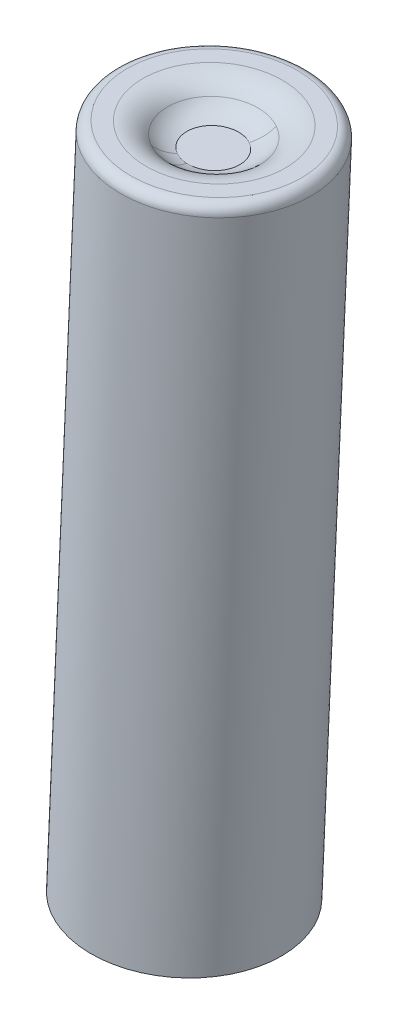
ISO-10303-21;
HEADER;
FILE_DESCRIPTION(('STEP AP214'),'2;1');
FILE_NAME('part.step','',(''),(''),'','','');
FILE_SCHEMA(('AUTOMOTIVE_DESIGN { 1 0 10303 214 1 1 1 1 }'));
ENDSEC;
DATA;
#1=APPLICATION_CONTEXT('core data for automotive mechanical design processes');
#2=APPLICATION_PROTOCOL_DEFINITION('international standard','automotive_design',2000,#1);
#3=PRODUCT_CONTEXT('',#1,'mechanical');
#4=PRODUCT('Part','Part','',(#3));
#5=PRODUCT_RELATED_PRODUCT_CATEGORY('part','',(#4));
#6=PRODUCT_DEFINITION_FORMATION('','',#4);
#7=PRODUCT_DEFINITION_CONTEXT('part definition',#1,'design');
#8=PRODUCT_DEFINITION('design','',#6,#7);
#9=PRODUCT_DEFINITION_SHAPE('','',#8);
#10=(LENGTH_UNIT() NAMED_UNIT(*) SI_UNIT(.MILLI.,.METRE.));
#11=(NAMED_UNIT(*) PLANE_ANGLE_UNIT() SI_UNIT($,.RADIAN.));
#12=(NAMED_UNIT(*) SI_UNIT($,.STERADIAN.) SOLID_ANGLE_UNIT());
#13=UNCERTAINTY_MEASURE_WITH_UNIT(LENGTH_MEASURE(1.E-05),#10,'distance_accuracy_value','');
#14=(GEOMETRIC_REPRESENTATION_CONTEXT(3) GLOBAL_UNCERTAINTY_ASSIGNED_CONTEXT((#13)) GLOBAL_UNIT_ASSIGNED_CONTEXT((#10,
#11,#12)) REPRESENTATION_CONTEXT('',''));
#15=CARTESIAN_POINT('',(0.,0.,0.));
#16=DIRECTION('',(0.,0.,1.));
#17=DIRECTION('',(1.,0.,0.));
#18=AXIS2_PLACEMENT_3D('',#15,#16,#17);
#19=CARTESIAN_POINT('',(-46.0249156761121,14.6776941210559,-31.025762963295));
#20=DIRECTION('',(-0.0440198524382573,-0.999030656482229,0.));
#21=DIRECTION('',(0.999030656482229,-0.0440198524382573,0.));
#22=AXIS2_PLACEMENT_3D('',#19,#20,#21);
#23=PLANE('',#22);
#24=CARTESIAN_POINT('',(-45.6540864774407,14.6613544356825,-32.4794569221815));
#25=CARTESIAN_POINT('',(-45.6922557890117,14.663036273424,-32.5003712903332));
#26=CARTESIAN_POINT('',(-45.732210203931,14.6647967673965,-32.5179918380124));
#27=CARTESIAN_POINT('',(-45.8144709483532,14.6684213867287,-32.5462896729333));
#28=CARTESIAN_POINT('',(-45.8567755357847,14.6702854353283,-32.5569720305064));
#29=CARTESIAN_POINT('',(-45.9425975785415,14.674066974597,-32.5710727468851));
#30=CARTESIAN_POINT('',(-45.9861155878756,14.6759844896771,-32.5744877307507));
#31=CARTESIAN_POINT('',(-46.0730975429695,14.6798171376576,-32.573957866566));
#32=CARTESIAN_POINT('',(-46.1165614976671,14.6817322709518,-32.5700144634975));
#33=CARTESIAN_POINT('',(-46.202215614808,14.6855064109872,-32.5548788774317));
#34=CARTESIAN_POINT('',(-46.2444056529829,14.6873654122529,-32.5436859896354));
#35=CARTESIAN_POINT('',(-46.3263096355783,14.6909743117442,-32.5143692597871));
#36=CARTESIAN_POINT('',(-46.3660235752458,14.6927242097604,-32.4962454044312));
#37=CARTESIAN_POINT('',(-46.4418491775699,14.6960652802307,-32.4535803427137));
#38=CARTESIAN_POINT('',(-46.4779607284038,14.6976564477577,-32.4290389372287));
#39=CARTESIAN_POINT('',(-46.5455527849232,14.7006347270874,-32.3742375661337));
#40=CARTESIAN_POINT('',(-46.5770335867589,14.7020218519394,-32.3439779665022));
#41=CARTESIAN_POINT('',(-46.6344739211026,14.704552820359,-32.2785974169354));
#42=CARTESIAN_POINT('',(-46.6604333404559,14.7056966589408,-32.2434763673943));
#43=CARTESIAN_POINT('',(-46.7060937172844,14.7077085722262,-32.1693694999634));
#44=CARTESIAN_POINT('',(-46.7257945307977,14.7085766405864,-32.1303835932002));
#45=CARTESIAN_POINT('',(-46.7583774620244,14.7100123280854,-32.0496548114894));
#46=CARTESIAN_POINT('',(-46.771259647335,14.7105799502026,-32.0079119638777));
#47=CARTESIAN_POINT('',(-46.7898398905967,14.7113986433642,-31.922854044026));
#48=CARTESIAN_POINT('',(-46.7955379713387,14.7116497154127,-31.8795389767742));
#49=CARTESIAN_POINT('',(-46.7995884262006,14.7118281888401,-31.7925649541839));
#50=CARTESIAN_POINT('',(-46.7979406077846,14.7117555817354,-31.7489059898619));
#51=CARTESIAN_POINT('',(-46.7873456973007,14.711288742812,-31.6624867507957));
#52=CARTESIAN_POINT('',(-46.778398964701,14.7108945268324,-31.6197264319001));
#53=CARTESIAN_POINT('',(-46.7534607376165,14.7097956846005,-31.5363145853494));
#54=CARTESIAN_POINT('',(-46.7374689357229,14.7090910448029,-31.4956631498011));
#55=CARTESIAN_POINT('',(-46.6988928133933,14.7073912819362,-31.4176251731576));
#56=CARTESIAN_POINT('',(-46.6763087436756,14.7063961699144,-31.3802385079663));
#57=CARTESIAN_POINT('',(-46.6251778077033,14.7041432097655,-31.3097672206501));
#58=CARTESIAN_POINT('',(-46.5966262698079,14.702885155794,-31.2766860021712));
#59=CARTESIAN_POINT('',(-46.5343966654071,14.700143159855,-31.2158271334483));
#60=CARTESIAN_POINT('',(-46.5007265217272,14.6986595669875,-31.188041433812));
#61=CARTESIAN_POINT('',(-46.4538460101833,14.6965938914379,-31.1555695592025));
#62=CARTESIAN_POINT('',(-46.4424744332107,14.6960928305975,-31.148129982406));
#63=CARTESIAN_POINT('',(-46.4193749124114,14.6950750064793,-31.1338720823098));
#64=CARTESIAN_POINT('',(-46.4076475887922,14.6945582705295,-31.1270527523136));
#65=CARTESIAN_POINT('',(-46.3957448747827,14.6940338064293,-31.1205430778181));
#66=B_SPLINE_CURVE_WITH_KNOTS('',3,(#24,#25,#26,#27,#28,#29,#30,#31,#32,#33,#34,#35,#36,#37,#38,
#39,#40,#41,#42,#43,#44,#45,#46,#47,#48,#49,#50,#51,#52,#53,#54,#55,#56,#57,#58,#59,#60,#61,#62,
#63,#64,#65),.UNSPECIFIED.,.F.,.F.,(4,2,2,2,2,2,2,2,2,2,2,2,2,2,2,2,2,2,2,2,4),(0.,
0.13049475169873,0.26089403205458,0.391353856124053,0.521788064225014,0.652234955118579,
0.782682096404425,0.913133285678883,1.04357612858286,1.17402164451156,1.30447016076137,
1.43491738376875,1.56536419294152,1.69581442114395,1.8262582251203,1.95670772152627,
2.08715225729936,2.21769929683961,2.34804628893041,2.38882776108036,2.42954181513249),.UNSPECIFIED.);
#67=CARTESIAN_POINT('',(-45.6540864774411,14.6613544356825,-32.4794569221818));
#68=VERTEX_POINT('',#67);
#69=CARTESIAN_POINT('',(-46.3957448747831,14.6940338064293,-31.1205430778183));
#70=VERTEX_POINT('',#69);
#71=EDGE_CURVE('E69',#68,#70,#66,.T.);
#72=ORIENTED_EDGE('',*,*,#71,.T.);
#73=CARTESIAN_POINT('',(-46.3957448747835,14.6940338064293,-31.1205430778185));
#74=CARTESIAN_POINT('',(-46.3683357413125,14.6928260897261,-31.1055449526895));
#75=CARTESIAN_POINT('',(-46.3400137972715,14.6915781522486,-31.0922258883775));
#76=CARTESIAN_POINT('',(-46.282026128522,14.6890230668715,-31.0691241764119));
#77=CARTESIAN_POINT('',(-46.2523630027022,14.6877160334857,-31.0593349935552));
#78=CARTESIAN_POINT('',(-46.1903352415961,14.6849829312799,-31.0429563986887));
#79=CARTESIAN_POINT('',(-46.1579133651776,14.6835543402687,-31.0365834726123));
#80=CARTESIAN_POINT('',(-46.0919729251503,14.6806488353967,-31.0279450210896));
#81=CARTESIAN_POINT('',(-46.0584450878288,14.6791715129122,-31.0257503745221));
#82=CARTESIAN_POINT('',(-46.0249156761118,14.6776941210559,-31.025762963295));
#83=B_SPLINE_CURVE_WITH_KNOTS('',3,(#73,#74,#75,#76,#77,#78,#79,#80,#81,#82),.UNSPECIFIED.,.F.,
.F.,(4,2,2,2,4),(0.,0.0937398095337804,0.187305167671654,0.286253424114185,0.386865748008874),.UNSPECIFIED.);
#84=CARTESIAN_POINT('',(-46.024915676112,14.6776941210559,-31.025762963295));
#85=VERTEX_POINT('',#84);
#86=EDGE_CURVE('E64',#70,#85,#83,.T.);
#87=ORIENTED_EDGE('',*,*,#86,.T.);
#88=CARTESIAN_POINT('',(-46.0249156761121,14.6776941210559,-31.025762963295));
#89=CARTESIAN_POINT('',(-45.9814018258,14.675776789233,-31.0257259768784));
#90=CARTESIAN_POINT('',(-45.9378990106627,14.6738599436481,-31.0294362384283));
#91=CARTESIAN_POINT('',(-45.85215485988,14.6700818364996,-31.0440787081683));
#92=CARTESIAN_POINT('',(-45.8099126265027,14.6682205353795,-31.0550056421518));
#93=CARTESIAN_POINT('',(-45.7278429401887,14.6646043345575,-31.0838163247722));
#94=CARTESIAN_POINT('',(-45.6880166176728,14.6628494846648,-31.101703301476));
#95=CARTESIAN_POINT('',(-45.6119365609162,14.6594972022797,-31.1439101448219));
#96=CARTESIAN_POINT('',(-45.5756821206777,14.6578997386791,-31.1682287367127));
#97=CARTESIAN_POINT('',(-45.5077629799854,14.654907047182,-31.2226160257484));
#98=CARTESIAN_POINT('',(-45.4760987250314,14.6535118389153,-31.2526852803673));
#99=CARTESIAN_POINT('',(-45.418262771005,14.650963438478,-31.3177180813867));
#100=CARTESIAN_POINT('',(-45.3920910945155,14.6498102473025,-31.3526816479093));
#101=CARTESIAN_POINT('',(-45.3459825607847,14.6477785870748,-31.4265120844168));
#102=CARTESIAN_POINT('',(-45.3260459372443,14.6469001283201,-31.4653791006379));
#103=CARTESIAN_POINT('',(-45.2929761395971,14.6454429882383,-31.5459086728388));
#104=CARTESIAN_POINT('',(-45.2798424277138,14.6448642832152,-31.5875710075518));
#105=CARTESIAN_POINT('',(-45.260748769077,14.6440229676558,-31.6725117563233));
#106=CARTESIAN_POINT('',(-45.2547888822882,14.6437603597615,-31.7157901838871));
#107=CARTESIAN_POINT('',(-45.250212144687,14.6435586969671,-31.802737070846));
#108=CARTESIAN_POINT('',(-45.2515957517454,14.643619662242,-31.8464055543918));
#109=CARTESIAN_POINT('',(-45.2616675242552,14.6440634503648,-31.9328889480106));
#110=CARTESIAN_POINT('',(-45.2703555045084,14.6444462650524,-31.9757038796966));
#111=CARTESIAN_POINT('',(-45.2947894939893,14.6455228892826,-32.059265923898));
#112=CARTESIAN_POINT('',(-45.3105354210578,14.6462166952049,-32.1000130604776));
#113=CARTESIAN_POINT('',(-45.3486377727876,14.6478955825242,-32.1782841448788));
#114=CARTESIAN_POINT('',(-45.3709946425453,14.6488806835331,-32.215807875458));
#115=CARTESIAN_POINT('',(-45.4216874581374,14.6511143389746,-32.2865663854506));
#116=CARTESIAN_POINT('',(-45.4500226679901,14.6523628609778,-32.3198016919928));
#117=CARTESIAN_POINT('',(-45.5066076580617,14.6548561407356,-32.375834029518));
#118=CARTESIAN_POINT('',(-45.5340587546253,14.6560657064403,-32.3994455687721));
#119=CARTESIAN_POINT('',(-45.5919577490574,14.6586168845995,-32.442601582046));
#120=CARTESIAN_POINT('',(-45.6224037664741,14.6599584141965,-32.4621485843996));
#121=CARTESIAN_POINT('',(-45.6540864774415,14.6613544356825,-32.479456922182));
#122=B_SPLINE_CURVE_WITH_KNOTS('',3,(#88,#89,#90,#91,#92,#93,#94,#95,#96,#97,#98,#99,#100,#101,
#102,#103,#104,#105,#106,#107,#108,#109,#110,#111,#112,#113,#114,#115,#116,#117,#118,#119,#120,
#121),.UNSPECIFIED.,.F.,.F.,(4,2,2,2,2,2,2,2,2,2,2,2,2,2,2,2,4),(0.,0.130494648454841,
0.260894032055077,0.391353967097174,0.521788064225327,0.652234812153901,0.782682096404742,
0.91313426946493,1.04357612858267,1.17401907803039,1.30447016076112,1.43491793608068,
1.56536419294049,1.69581923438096,1.82625822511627,1.93460032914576,2.04287483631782),.UNSPECIFIED.);
#123=EDGE_CURVE('E66',#85,#68,#122,.T.);
#124=ORIENTED_EDGE('',*,*,#123,.T.);
#125=EDGE_LOOP('',(#72,#87,#124));
#126=FACE_BOUND('',#125,.T.);
#127=ADVANCED_FACE('F17',(#126),#23,.F.);
#128=CARTESIAN_POINT('',(-46.0108051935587,14.9979315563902,-30.4508095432));
#129=CARTESIAN_POINT('',(-44.2634499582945,14.9209386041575,-30.4508095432));
#130=CARTESIAN_POINT('',(-43.831147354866,14.9018902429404,-32.1454864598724));
#131=CARTESIAN_POINT('',(-45.3645958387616,14.9694579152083,-32.9840260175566));
#132=CARTESIAN_POINT('',(-46.0121018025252,14.9685050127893,-30.47784450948));
#133=CARTESIAN_POINT('',(-44.2997599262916,14.8930548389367,-30.47784450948));
#134=CARTESIAN_POINT('',(-43.8761197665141,14.8743881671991,-32.1385636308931));
#135=CARTESIAN_POINT('',(-45.3788411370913,14.9406019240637,-32.9603006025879));
#136=CARTESIAN_POINT('',(-46.0133324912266,14.9405745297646,-30.50616038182));
#137=CARTESIAN_POINT('',(-44.3376628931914,14.8667402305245,-30.50616038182));
#138=CARTESIAN_POINT('',(-43.923095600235,14.8484733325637,-32.1313128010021));
#139=CARTESIAN_POINT('',(-45.3936340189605,14.9132690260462,-32.9354510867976));
#140=CARTESIAN_POINT('',(-46.0144972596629,14.9141401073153,-30.5357571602));
#141=CARTESIAN_POINT('',(-44.377158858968,14.8419947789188,-30.5357571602));
#142=CARTESIAN_POINT('',(-43.9720748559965,14.8241457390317,-32.1237339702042));
#143=CARTESIAN_POINT('',(-45.4089744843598,14.8874592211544,-32.9094774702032));
#144=CARTESIAN_POINT('',(-46.0180702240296,14.8330516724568,-30.63615762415));
#145=CARTESIAN_POINT('',(-44.5107618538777,14.7666358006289,-30.63615762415));
#146=CARTESIAN_POINT('',(-44.1378477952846,14.7502042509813,-32.0980244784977));
#147=CARTESIAN_POINT('',(-45.4606353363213,14.8084896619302,-32.821367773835));
#148=CARTESIAN_POINT('',(-46.0209462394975,14.767780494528,-30.75010060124));
#149=CARTESIAN_POINT('',(-44.6612069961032,14.7078668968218,-30.75010060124));
#150=CARTESIAN_POINT('',(-44.3248021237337,14.693044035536,-32.0688471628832));
#151=CARTESIAN_POINT('',(-45.5180855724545,14.7456231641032,-32.721373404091));
#152=CARTESIAN_POINT('',(-46.0226035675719,14.730167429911,-30.835494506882));
#153=CARTESIAN_POINT('',(-44.7734591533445,14.6751269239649,-30.835494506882));
#154=CARTESIAN_POINT('',(-44.4644158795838,14.6615096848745,-32.0469803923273));
#155=CARTESIAN_POINT('',(-45.5606432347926,14.7098122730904,-32.6464332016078));
#156=CARTESIAN_POINT('',(-46.0239267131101,14.7001386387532,-30.9273819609));
#157=CARTESIAN_POINT('',(-44.8937870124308,14.6503417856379,-30.9273819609));
#158=CARTESIAN_POINT('',(-44.614185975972,14.6380218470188,-32.0234508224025));
#159=CARTESIAN_POINT('',(-45.6059768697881,14.6817226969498,-32.5657943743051));
#160=CARTESIAN_POINT('',(-46.0249156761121,14.6776941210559,-31.025762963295));
#161=CARTESIAN_POINT('',(-45.0221905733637,14.6335114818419,-31.025762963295));
#162=CARTESIAN_POINT('',(-44.7741124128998,14.62258052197,-31.998258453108));
#163=CARTESIAN_POINT('',(-45.6540864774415,14.6613544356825,-32.479456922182));
#164=(BOUNDED_SURFACE() B_SPLINE_SURFACE(5,3,((#128,#129,#130,#131),(#132,#133,#134,#135),(#136,
#137,#138,#139),(#140,#141,#142,#143),(#144,#145,#146,#147),(#148,#149,#150,#151),(#152,#153,
#154,#155),(#156,#157,#158,#159),(#160,#161,#162,#163)),.UNSPECIFIED.,.F.,.F.,
.F.) B_SPLINE_SURFACE_WITH_KNOTS((6,3,6),(4,4),(0.582420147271,0.789666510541,1.2562929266),(0.,
1.),.UNSPECIFIED.) GEOMETRIC_REPRESENTATION_ITEM() RATIONAL_B_SPLINE_SURFACE(((1.,
0.49826930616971,0.49826930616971,1.),(1.,0.49826930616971,0.49826930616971,1.),(1.,
0.49826930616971,0.49826930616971,1.),(1.,0.49826930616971,0.49826930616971,1.),(1.,
0.49826930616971,0.49826930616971,1.),(1.,0.49826930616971,0.49826930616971,1.),(1.,
0.49826930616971,0.49826930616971,1.),(1.,0.49826930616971,0.49826930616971,1.),(1.,
0.49826930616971,0.49826930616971,1.))) REPRESENTATION_ITEM('') SURFACE());
#165=CARTESIAN_POINT('',(-46.0108051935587,14.9979315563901,-31.8));
#166=DIRECTION('',(-0.0440198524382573,-0.999030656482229,0.));
#167=DIRECTION('',(-0.127842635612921,0.00563307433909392,-0.991778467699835));
#168=AXIS2_PLACEMENT_3D('',#165,#166,#167);
#169=CIRCLE('',#168,1.34919045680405);
#170=CARTESIAN_POINT('',(-45.3645958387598,14.9694579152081,-32.984026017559));
#171=VERTEX_POINT('',#170);
#172=CARTESIAN_POINT('',(-46.0108051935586,14.9979315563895,-30.4508095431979));
#173=VERTEX_POINT('',#172);
#174=EDGE_CURVE('E77',#171,#173,#169,.T.);
#175=CARTESIAN_POINT('',(-45.3645958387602,14.9694579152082,-32.9840260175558));
#176=CARTESIAN_POINT('',(-45.3788411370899,14.9406019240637,-32.9603006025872));
#177=CARTESIAN_POINT('',(-45.3936340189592,14.9132690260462,-32.9354510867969));
#178=CARTESIAN_POINT('',(-45.4089744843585,14.8874592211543,-32.9094774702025));
#179=CARTESIAN_POINT('',(-45.4606353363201,14.8084896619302,-32.8213677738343));
#180=CARTESIAN_POINT('',(-45.5180855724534,14.7456231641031,-32.7213734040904));
#181=CARTESIAN_POINT('',(-45.5606432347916,14.7098122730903,-32.6464332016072));
#182=CARTESIAN_POINT('',(-45.6059768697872,14.6817226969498,-32.5657943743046));
#183=CARTESIAN_POINT('',(-45.6540864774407,14.6613544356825,-32.4794569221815));
#184=B_SPLINE_CURVE_WITH_KNOTS('',5,(#175,#176,#177,#178,#179,#180,#181,#182,#183),
.UNSPECIFIED.,.F.,.F.,(6,3,6),(0.582420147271,0.789666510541,1.2562929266),.UNSPECIFIED.);
#185=EDGE_CURVE('E74',#171,#68,#184,.T.);
#186=CARTESIAN_POINT('',(-46.0108051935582,14.9979315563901,-30.4508095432));
#187=CARTESIAN_POINT('',(-46.0121018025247,14.9685050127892,-30.47784450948));
#188=CARTESIAN_POINT('',(-46.0133324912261,14.9405745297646,-30.50616038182));
#189=CARTESIAN_POINT('',(-46.0144972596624,14.9141401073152,-30.5357571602));
#190=CARTESIAN_POINT('',(-46.0180702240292,14.8330516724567,-30.63615762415));
#191=CARTESIAN_POINT('',(-46.0209462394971,14.767780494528,-30.75010060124));
#192=CARTESIAN_POINT('',(-46.0226035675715,14.7301674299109,-30.835494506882));
#193=CARTESIAN_POINT('',(-46.0239267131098,14.7001386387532,-30.9273819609));
#194=CARTESIAN_POINT('',(-46.0249156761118,14.6776941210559,-31.025762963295));
#195=B_SPLINE_CURVE_WITH_KNOTS('',5,(#186,#187,#188,#189,#190,#191,#192,#193,#194),
.UNSPECIFIED.,.F.,.F.,(6,3,6),(0.582420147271,0.789666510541,1.2562929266),.UNSPECIFIED.);
#196=EDGE_CURVE('E81',#85,#173,#195,.F.);
#197=ORIENTED_EDGE('',*,*,#174,.F.);
#198=ORIENTED_EDGE('',*,*,#185,.T.);
#199=ORIENTED_EDGE('',*,*,#123,.F.);
#200=ORIENTED_EDGE('',*,*,#196,.T.);
#201=EDGE_LOOP('',(#197,#198,#199,#200));
#202=FACE_BOUND('',#201,.T.);
#203=ADVANCED_FACE('F75',(#202),#164,.F.);
#204=CARTESIAN_POINT('',(-46.6570145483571,15.0264051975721,-30.6159739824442));
#205=CARTESIAN_POINT('',(-46.4577863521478,15.0176266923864,-30.5070295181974));
#206=CARTESIAN_POINT('',(-46.2378245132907,15.0079346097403,-30.4508095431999));
#207=CARTESIAN_POINT('',(-46.0108051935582,14.9979315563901,-30.4508095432));
#208=CARTESIAN_POINT('',(-46.6453624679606,14.9964081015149,-30.6396993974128));
#209=CARTESIAN_POINT('',(-46.4501263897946,14.9878054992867,-30.5329379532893));
#210=CARTESIAN_POINT('',(-46.2345721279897,14.9783076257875,-30.4778445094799));
#211=CARTESIAN_POINT('',(-46.0121018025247,14.9685050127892,-30.47784450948));
#212=CARTESIAN_POINT('',(-46.6330309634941,14.9678800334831,-30.6645489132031));
#213=CARTESIAN_POINT('',(-46.4419761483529,14.9594616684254,-30.5600739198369));
#214=CARTESIAN_POINT('',(-46.2310382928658,14.9501672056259,-30.5061603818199));
#215=CARTESIAN_POINT('',(-46.0133324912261,14.9405745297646,-30.50616038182));
#216=CARTESIAN_POINT('',(-46.6200200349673,14.9408209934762,-30.6905225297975));
#217=CARTESIAN_POINT('',(-46.4333356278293,14.9325951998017,-30.5884374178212));
#218=CARTESIAN_POINT('',(-46.2272230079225,14.9235133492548,-30.5357571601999));
#219=CARTESIAN_POINT('',(-46.0144972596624,14.9141401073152,-30.5357571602));
#220=CARTESIAN_POINT('',(-46.5755051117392,14.8576136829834,-30.7786322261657));
#221=CARTESIAN_POINT('',(-46.4036463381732,14.8500411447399,-30.684654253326));
#222=CARTESIAN_POINT('',(-46.2139022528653,14.8416805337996,-30.6361576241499));
#223=CARTESIAN_POINT('',(-46.0180702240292,14.8330516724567,-30.63615762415));
#224=CARTESIAN_POINT('',(-46.5238069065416,14.7899378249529,-30.8786265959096));
#225=CARTESIAN_POINT('',(-46.368773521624,14.783106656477,-30.7938492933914));
#226=CARTESIAN_POINT('',(-46.1976058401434,14.7755645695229,-30.75010060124));
#227=CARTESIAN_POINT('',(-46.0209462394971,14.767780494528,-30.75010060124));
#228=CARTESIAN_POINT('',(-46.4845639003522,14.7505225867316,-30.9535667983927));
#229=CARTESIAN_POINT('',(-46.3421402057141,14.7442470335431,-30.8756848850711));
#230=CARTESIAN_POINT('',(-46.1848945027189,14.7373183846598,-30.835494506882));
#231=CARTESIAN_POINT('',(-46.0226035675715,14.7301674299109,-30.835494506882));
#232=CARTESIAN_POINT('',(-46.441876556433,14.7185545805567,-31.0342056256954));
#233=CARTESIAN_POINT('',(-46.3130214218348,14.7128768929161,-30.9637434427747));
#234=CARTESIAN_POINT('',(-46.1707563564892,14.706608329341,-30.9273819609));
#235=CARTESIAN_POINT('',(-46.0239267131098,14.7001386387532,-30.9273819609));
#236=CARTESIAN_POINT('',(-46.3957448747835,14.6940338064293,-31.1205430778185));
#237=CARTESIAN_POINT('',(-46.2814171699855,14.6889962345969,-31.0580249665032));
#238=CARTESIAN_POINT('',(-46.1551914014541,14.6834344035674,-31.025762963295));
#239=CARTESIAN_POINT('',(-46.0249156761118,14.6776941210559,-31.025762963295));
#240=(BOUNDED_SURFACE() B_SPLINE_SURFACE(5,3,((#204,#205,#206,#207),(#208,#209,#210,#211),(#212,
#213,#214,#215),(#216,#217,#218,#219),(#220,#221,#222,#223),(#224,#225,#226,#227),(#228,#229,
#230,#231),(#232,#233,#234,#235),(#236,#237,#238,#239)),.UNSPECIFIED.,.F.,.F.,
.F.) B_SPLINE_SURFACE_WITH_KNOTS((6,3,6),(4,4),(0.582420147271,0.789666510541,1.2562929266),(0.,
1.),.UNSPECIFIED.) GEOMETRIC_REPRESENTATION_ITEM() RATIONAL_B_SPLINE_SURFACE(((1.,
0.979274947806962,0.979274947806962,1.),(1.,0.979274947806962,0.979274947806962,1.),(1.,
0.979274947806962,0.979274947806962,1.),(1.,0.979274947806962,0.979274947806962,1.),(1.,
0.979274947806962,0.979274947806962,1.),(1.,0.979274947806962,0.979274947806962,1.),(1.,
0.979274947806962,0.979274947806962,1.),(1.,0.979274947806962,0.979274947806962,1.),(1.,
0.979274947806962,0.979274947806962,1.))) REPRESENTATION_ITEM('') SURFACE());
#241=CARTESIAN_POINT('',(-46.6570145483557,15.026405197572,-30.6159739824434));
#242=CARTESIAN_POINT('',(-46.6453624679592,14.9964081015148,-30.6396993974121));
#243=CARTESIAN_POINT('',(-46.6330309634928,14.967880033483,-30.6645489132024));
#244=CARTESIAN_POINT('',(-46.620020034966,14.9408209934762,-30.6905225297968));
#245=CARTESIAN_POINT('',(-46.575505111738,14.8576136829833,-30.778632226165));
#246=CARTESIAN_POINT('',(-46.5238069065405,14.7899378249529,-30.8786265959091));
#247=CARTESIAN_POINT('',(-46.4845639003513,14.7505225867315,-30.9535667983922));
#248=CARTESIAN_POINT('',(-46.4418765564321,14.7185545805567,-31.0342056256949));
#249=CARTESIAN_POINT('',(-46.3957448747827,14.6940338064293,-31.1205430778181));
#250=B_SPLINE_CURVE_WITH_KNOTS('',5,(#241,#242,#243,#244,#245,#246,#247,#248,#249),
.UNSPECIFIED.,.F.,.F.,(6,3,6),(0.582420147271,0.789666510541,1.2562929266),.UNSPECIFIED.);
#251=CARTESIAN_POINT('',(-46.657014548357,15.0264051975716,-30.6159739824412));
#252=VERTEX_POINT('',#251);
#253=EDGE_CURVE('E85',#70,#252,#250,.F.);
#254=CARTESIAN_POINT('',(-46.0108051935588,14.9979315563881,-31.8));
#255=DIRECTION('',(-0.0440198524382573,-0.999030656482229,0.));
#256=DIRECTION('',(-0.127842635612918,0.00563307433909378,-0.991778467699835));
#257=AXIS2_PLACEMENT_3D('',#254,#255,#256);
#258=CIRCLE('',#257,1.34919045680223);
#259=EDGE_CURVE('E229',#173,#252,#258,.T.);
#260=ORIENTED_EDGE('',*,*,#196,.F.);
#261=ORIENTED_EDGE('',*,*,#86,.F.);
#262=ORIENTED_EDGE('',*,*,#253,.T.);
#263=ORIENTED_EDGE('',*,*,#259,.F.);
#264=EDGE_LOOP('',(#260,#261,#262,#263));
#265=FACE_BOUND('',#264,.T.);
#266=ADVANCED_FACE('F108',(#265),#240,.F.);
#267=CARTESIAN_POINT('',(-45.3645958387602,14.9694579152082,-32.9840260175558));
#268=CARTESIAN_POINT('',(-47.7303524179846,15.0736992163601,-34.2776987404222));
#269=CARTESIAN_POINT('',(-49.0227711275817,15.130646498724,-31.9096467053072));
#270=CARTESIAN_POINT('',(-46.6570145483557,15.026405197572,-30.6159739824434));
#271=CARTESIAN_POINT('',(-45.3788411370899,14.9406019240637,-32.9603006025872));
#272=CARTESIAN_POINT('',(-47.6971928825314,15.0427544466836,-34.2280508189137));
#273=CARTESIAN_POINT('',(-48.9637142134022,15.0985606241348,-31.9074496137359));
#274=CARTESIAN_POINT('',(-46.6453624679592,14.9964081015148,-30.6396993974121));
#275=CARTESIAN_POINT('',(-45.3936340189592,14.9132690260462,-32.9354510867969));
#276=CARTESIAN_POINT('',(-47.6623349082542,15.0132338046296,-34.176050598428));
#277=CARTESIAN_POINT('',(-48.9017318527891,15.0678448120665,-31.9051484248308));
#278=CARTESIAN_POINT('',(-46.6330309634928,14.967880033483,-30.6645489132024));
#279=CARTESIAN_POINT('',(-45.4089744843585,14.8874592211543,-32.9094774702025));
#280=CARTESIAN_POINT('',(-47.6257784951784,14.9851372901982,-34.1216980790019));
#281=CARTESIAN_POINT('',(-48.8368240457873,15.0384990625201,-31.9027431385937));
#282=CARTESIAN_POINT('',(-46.620020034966,14.9408209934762,-30.6905225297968));
#283=CARTESIAN_POINT('',(-45.4606353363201,14.8084896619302,-32.8213677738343));
#284=CARTESIAN_POINT('',(-47.5013907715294,14.898410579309,-33.9373192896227));
#285=CARTESIAN_POINT('',(-48.6162605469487,14.9475346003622,-31.894583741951));
#286=CARTESIAN_POINT('',(-46.575505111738,14.8576136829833,-30.778632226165));
#287=CARTESIAN_POINT('',(-45.5180855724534,14.7456231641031,-32.7213734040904));
#288=CARTESIAN_POINT('',(-47.3590461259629,14.8267406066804,-33.7280705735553));
#289=CARTESIAN_POINT('',(-48.3647674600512,14.8710552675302,-31.8853237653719));
#290=CARTESIAN_POINT('',(-46.5238069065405,14.7899378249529,-30.8786265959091));
#291=CARTESIAN_POINT('',(-45.5606432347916,14.7098122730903,-32.6464332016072));
#292=CARTESIAN_POINT('',(-47.2518686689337,14.7843320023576,-33.57125033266));
#293=CARTESIAN_POINT('',(-48.1757893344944,14.8250423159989,-31.878383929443));
#294=CARTESIAN_POINT('',(-46.4845639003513,14.7505225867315,-30.9535667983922));
#295=CARTESIAN_POINT('',(-45.6059768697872,14.6817226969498,-32.5657943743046));
#296=CARTESIAN_POINT('',(-47.1360809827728,14.7491430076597,-33.40250512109));
#297=CARTESIAN_POINT('',(-47.9719806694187,14.7859748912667,-31.8709163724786));
#298=CARTESIAN_POINT('',(-46.4418765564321,14.7185545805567,-31.0342056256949));
#299=CARTESIAN_POINT('',(-45.6540864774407,14.6613544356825,-32.4794569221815));
#300=CARTESIAN_POINT('',(-47.0116830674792,14.7211736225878,-33.2218349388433));
#301=CARTESIAN_POINT('',(-47.753341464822,14.7538529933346,-31.8629210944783));
#302=CARTESIAN_POINT('',(-46.3957448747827,14.6940338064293,-31.1205430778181));
#303=(BOUNDED_SURFACE() B_SPLINE_SURFACE(5,3,((#267,#268,#269,#270),(#271,#272,#273,#274),(#275,
#276,#277,#278),(#279,#280,#281,#282),(#283,#284,#285,#286),(#287,#288,#289,#290),(#291,#292,
#293,#294),(#295,#296,#297,#298),(#299,#300,#301,#302)),.UNSPECIFIED.,.F.,.F.,
.F.) B_SPLINE_SURFACE_WITH_KNOTS((6,3,6),(4,4),(0.582420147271,0.789666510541,1.2562929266),(0.,
1.),.UNSPECIFIED.) GEOMETRIC_REPRESENTATION_ITEM() RATIONAL_B_SPLINE_SURFACE(((1.,
0.333333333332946,0.333333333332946,1.),(1.,0.333333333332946,0.333333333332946,1.),(1.,
0.333333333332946,0.333333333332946,1.),(1.,0.333333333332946,0.333333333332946,1.),(1.,
0.333333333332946,0.333333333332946,1.),(1.,0.333333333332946,0.333333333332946,1.),(1.,
0.333333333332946,0.333333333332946,1.),(1.,0.333333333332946,0.333333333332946,1.),(1.,
0.333333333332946,0.333333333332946,1.))) REPRESENTATION_ITEM('') SURFACE());
#304=CARTESIAN_POINT('',(-46.0108051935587,14.9979315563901,-31.8));
#305=DIRECTION('',(-0.0440198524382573,-0.999030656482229,0.));
#306=DIRECTION('',(-0.478960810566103,0.021104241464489,0.877582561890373));
#307=AXIS2_PLACEMENT_3D('',#304,#305,#306);
#308=CIRCLE('',#307,1.34919045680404);
#309=EDGE_CURVE('E232',#252,#171,#308,.T.);
#310=ORIENTED_EDGE('',*,*,#71,.F.);
#311=ORIENTED_EDGE('',*,*,#185,.F.);
#312=ORIENTED_EDGE('',*,*,#309,.F.);
#313=ORIENTED_EDGE('',*,*,#253,.F.);
#314=EDGE_LOOP('',(#310,#311,#312,#313));
#315=FACE_BOUND('',#314,.T.);
#316=ADVANCED_FACE('F84',(#315),#303,.F.);
#317=CARTESIAN_POINT('',(-46.0845909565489,13.3233634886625,-31.8));
#318=DIRECTION('',(-0.0440198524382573,-0.999030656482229,0.));
#319=DIRECTION('',(0.999030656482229,-0.0440198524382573,0.));
#320=AXIS2_PLACEMENT_3D('',#317,#318,#319);
#321=PLANE('',#320);
#322=CARTESIAN_POINT('',(-46.0845909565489,13.3233634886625,-31.8));
#323=DIRECTION('',(-0.0440198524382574,-0.999030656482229,0.));
#324=DIRECTION('',(0.999030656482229,-0.0440198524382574,0.));
#325=AXIS2_PLACEMENT_3D('',#322,#323,#324);
#326=CIRCLE('',#325,2.25);
#327=CARTESIAN_POINT('',(-43.8367719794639,13.2243188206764,-31.8));
#328=VERTEX_POINT('',#327);
#329=EDGE_CURVE('E95',#328,#328,#326,.T.);
#330=ORIENTED_EDGE('',*,*,#329,.T.);
#331=EDGE_LOOP('',(#330));
#332=FACE_BOUND('',#331,.T.);
#333=ADVANCED_FACE('F107',(#332),#321,.T.);
#334=CARTESIAN_POINT('',(-46.0405711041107,14.3223941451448,-31.8));
#335=DIRECTION('',(-0.0440198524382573,-0.999030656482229,0.));
#336=DIRECTION('',(-0.478960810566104,0.0211042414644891,0.877582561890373));
#337=AXIS2_PLACEMENT_3D('',#334,#335,#336);
#338=TOROIDAL_SURFACE('',#337,2.08591509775,1.);
#339=ORIENTED_EDGE('',*,*,#259,.T.);
#340=ORIENTED_EDGE('',*,*,#309,.T.);
#341=ORIENTED_EDGE('',*,*,#174,.T.);
#342=EDGE_LOOP('',(#339,#340,#341));
#343=FACE_BOUND('',#342,.T.);
#344=CARTESIAN_POINT('',(-45.9965512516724,15.321424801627,-31.8));
#345=DIRECTION('',(0.0440198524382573,0.999030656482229,0.));
#346=DIRECTION('',(0.478960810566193,-0.0211042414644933,-0.877582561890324));
#347=AXIS2_PLACEMENT_3D('',#344,#345,#346);
#348=CIRCLE('',#347,2.08591509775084);
#349=CARTESIAN_POINT('',(-44.9974797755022,15.2774031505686,-33.6305627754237));
#350=VERTEX_POINT('',#349);
#351=CARTESIAN_POINT('',(-46.9956228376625,15.3654464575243,-29.9694372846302));
#352=VERTEX_POINT('',#351);
#353=EDGE_CURVE('E194',#350,#352,#348,.T.);
#354=ORIENTED_EDGE('',*,*,#353,.T.);
#355=CARTESIAN_POINT('',(-46.9956228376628,15.3654464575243,-29.9694372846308));
#356=CARTESIAN_POINT('',(-46.9692274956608,15.364283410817,-29.955002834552));
#357=CARTESIAN_POINT('',(-46.9425222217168,15.3631067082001,-29.9411361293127));
#358=CARTESIAN_POINT('',(-46.8885417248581,15.3607281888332,-29.9145616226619));
#359=CARTESIAN_POINT('',(-46.8612664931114,15.359526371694,-29.9018538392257));
#360=CARTESIAN_POINT('',(-46.8061959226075,15.3570998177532,-29.8776206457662));
#361=CARTESIAN_POINT('',(-46.7784005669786,15.3558750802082,-29.8660952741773));
#362=CARTESIAN_POINT('',(-46.7223388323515,15.3534048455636,-29.8442488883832));
#363=CARTESIAN_POINT('',(-46.694072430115,15.3521593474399,-29.8339279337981));
#364=CARTESIAN_POINT('',(-46.6513627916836,15.3502774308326,-29.8193611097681));
#365=CARTESIAN_POINT('',(-46.6370738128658,15.3496478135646,-29.8146577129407));
#366=CARTESIAN_POINT('',(-46.6083867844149,15.3483837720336,-29.8055614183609));
#367=CARTESIAN_POINT('',(-46.5939886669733,15.347749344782,-29.8011687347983));
#368=CARTESIAN_POINT('',(-46.550652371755,15.3458398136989,-29.7884739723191));
#369=CARTESIAN_POINT('',(-46.5215712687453,15.3445584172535,-29.7806548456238));
#370=CARTESIAN_POINT('',(-46.4630912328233,15.3419816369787,-29.7663238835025));
#371=CARTESIAN_POINT('',(-46.4336923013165,15.3406862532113,-29.7598120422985));
#372=CARTESIAN_POINT('',(-46.3746377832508,15.3380841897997,-29.7480838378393));
#373=CARTESIAN_POINT('',(-46.3449822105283,15.3367775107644,-29.7428674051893));
#374=CARTESIAN_POINT('',(-46.285462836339,15.334154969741,-29.7338365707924));
#375=CARTESIAN_POINT('',(-46.2555990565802,15.3328391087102,-29.7300220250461));
#376=CARTESIAN_POINT('',(-46.2101545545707,15.3308367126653,-29.725024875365));
#377=CARTESIAN_POINT('',(-46.1946127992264,15.330151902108,-29.7234588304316));
#378=CARTESIAN_POINT('',(-46.1251150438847,15.3270896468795,-29.7172460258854));
#379=CARTESIAN_POINT('',(-46.0709637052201,15.3247035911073,-29.7145283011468));
#380=CARTESIAN_POINT('',(-45.9916018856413,15.3212066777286,-29.71364542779));
#381=CARTESIAN_POINT('',(-45.9663933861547,15.3200959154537,-29.7138233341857));
#382=CARTESIAN_POINT('',(-45.9109662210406,15.3176536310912,-29.7152371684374));
#383=CARTESIAN_POINT('',(-45.8807518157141,15.3163222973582,-29.7166771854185));
#384=CARTESIAN_POINT('',(-45.8369454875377,15.3143920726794,-29.7197422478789));
#385=CARTESIAN_POINT('',(-45.8233138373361,15.3137914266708,-29.7208338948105));
#386=CARTESIAN_POINT('',(-45.7943027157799,15.3125131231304,-29.7234498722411));
#387=CARTESIAN_POINT('',(-45.778926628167,15.311835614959,-29.7250120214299));
#388=CARTESIAN_POINT('',(-45.7328573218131,15.309805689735,-29.7302146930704));
#389=CARTESIAN_POINT('',(-45.7022206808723,15.3084557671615,-29.7343716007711));
#390=CARTESIAN_POINT('',(-45.6411678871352,15.3057656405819,-29.7440613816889));
#391=CARTESIAN_POINT('',(-45.6107517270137,15.304425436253,-29.7495942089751));
#392=CARTESIAN_POINT('',(-45.5501952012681,15.3017571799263,-29.7620054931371));
#393=CARTESIAN_POINT('',(-45.5200548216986,15.3004291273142,-29.7688838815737));
#394=CARTESIAN_POINT('',(-45.4601300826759,15.297788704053,-29.7840408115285));
#395=CARTESIAN_POINT('',(-45.4303456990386,15.2964763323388,-29.7923192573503));
#396=CARTESIAN_POINT('',(-45.3886904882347,15.2946408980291,-29.804758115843));
#397=CARTESIAN_POINT('',(-45.3766759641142,15.2941115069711,-29.8084476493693));
#398=CARTESIAN_POINT('',(-45.3318817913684,15.2921377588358,-29.8226527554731));
#399=CARTESIAN_POINT('',(-45.2993236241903,15.2907031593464,-29.8338815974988));
#400=CARTESIAN_POINT('',(-45.2394298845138,15.288064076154,-29.8562054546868));
#401=CARTESIAN_POINT('',(-45.2120150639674,15.2868561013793,-29.8670886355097));
#402=CARTESIAN_POINT('',(-45.172511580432,15.2851154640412,-29.8837554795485));
#403=CARTESIAN_POINT('',(-45.1602277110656,15.2845742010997,-29.8890789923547));
#404=CARTESIAN_POINT('',(-45.1205195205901,15.282824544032,-29.9067510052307));
#405=CARTESIAN_POINT('',(-45.0933086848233,15.2816255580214,-29.9195847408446));
#406=CARTESIAN_POINT('',(-45.0374157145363,15.2791627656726,-29.9474701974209));
#407=CARTESIAN_POINT('',(-45.008780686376,15.2779010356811,-29.9626165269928));
#408=CARTESIAN_POINT('',(-44.9604925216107,15.2757733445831,-29.9896348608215));
#409=CARTESIAN_POINT('',(-44.9406532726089,15.27489918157,-30.0011750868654));
#410=CARTESIAN_POINT('',(-44.9029356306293,15.2732372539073,-30.0239536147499));
#411=CARTESIAN_POINT('',(-44.8850273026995,15.2724481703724,-30.0351422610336));
#412=CARTESIAN_POINT('',(-44.8485509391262,15.2708409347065,-30.058710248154));
#413=CARTESIAN_POINT('',(-44.8300032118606,15.2700236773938,-30.0711211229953));
#414=CARTESIAN_POINT('',(-44.7953688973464,15.2684976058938,-30.0951089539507));
#415=CARTESIAN_POINT('',(-44.7792392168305,15.2677868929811,-30.1066237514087));
#416=CARTESIAN_POINT('',(-44.7373875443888,15.2659428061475,-30.1374116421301));
#417=CARTESIAN_POINT('',(-44.7119370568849,15.2648213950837,-30.1570570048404));
#418=CARTESIAN_POINT('',(-44.6697335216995,15.2629618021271,-30.1912109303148));
#419=CARTESIAN_POINT('',(-44.652735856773,15.2622128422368,-30.2054182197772));
#420=CARTESIAN_POINT('',(-44.6267655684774,15.2610685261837,-30.2278405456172));
#421=CARTESIAN_POINT('',(-44.617631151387,15.2606660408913,-30.2358681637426));
#422=CARTESIAN_POINT('',(-44.6073350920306,15.2602123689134,-30.2450558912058));
#423=CARTESIAN_POINT('',(-44.6061130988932,15.2601585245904,-30.246148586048));
#424=CARTESIAN_POINT('',(-44.5886201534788,15.2593877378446,-30.2618262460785));
#425=CARTESIAN_POINT('',(-44.5725665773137,15.2586803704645,-30.2766561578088));
#426=CARTESIAN_POINT('',(-44.5346179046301,15.2570082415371,-30.3128584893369));
#427=CARTESIAN_POINT('',(-44.5129547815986,15.2560537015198,-30.3344751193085));
#428=CARTESIAN_POINT('',(-44.4706058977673,15.2541876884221,-30.3786477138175));
#429=CARTESIAN_POINT('',(-44.449920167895,15.2532762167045,-30.4012037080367));
#430=CARTESIAN_POINT('',(-44.409570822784,15.2514983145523,-30.4472145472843));
#431=CARTESIAN_POINT('',(-44.3899072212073,15.2506318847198,-30.4706694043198));
#432=CARTESIAN_POINT('',(-44.3516393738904,15.2489457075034,-30.5184294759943));
#433=CARTESIAN_POINT('',(-44.3330351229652,15.2481259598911,-30.5427346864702));
#434=CARTESIAN_POINT('',(-44.2969274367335,15.2465349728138,-30.5921497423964));
#435=CARTESIAN_POINT('',(-44.27942397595,15.2457637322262,-30.6172595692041));
#436=CARTESIAN_POINT('',(-44.2455370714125,15.2442706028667,-30.6682246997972));
#437=CARTESIAN_POINT('',(-44.2291535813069,15.2435487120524,-30.6940799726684));
#438=CARTESIAN_POINT('',(-44.1975972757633,15.2421582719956,-30.7465180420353));
#439=CARTESIAN_POINT('',(-44.1824243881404,15.2414897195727,-30.7731007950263));
#440=CARTESIAN_POINT('',(-44.1614207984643,15.2405642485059,-30.811577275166));
#441=CARTESIAN_POINT('',(-44.1551743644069,15.2402890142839,-30.8232469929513));
#442=CARTESIAN_POINT('',(-44.1325849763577,15.239293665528,-30.8664385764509));
#443=CARTESIAN_POINT('',(-44.1169359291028,15.2386041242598,-30.8983290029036));
#444=CARTESIAN_POINT('',(-44.0894560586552,15.2373932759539,-30.95812188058));
#445=CARTESIAN_POINT('',(-44.0774020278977,15.2368621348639,-30.9859220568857));
#446=CARTESIAN_POINT('',(-44.0607323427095,15.2361276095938,-31.0267954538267));
#447=CARTESIAN_POINT('',(-44.0556306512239,15.235902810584,-31.0396716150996));
#448=CARTESIAN_POINT('',(-44.0395042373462,15.2351922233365,-31.0816063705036));
#449=CARTESIAN_POINT('',(-44.0290061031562,15.2347296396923,-31.1108700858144));
#450=CARTESIAN_POINT('',(-44.0086200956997,15.2338313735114,-31.1720476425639));
#451=CARTESIAN_POINT('',(-43.9988362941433,15.2334002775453,-31.203996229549));
#452=CARTESIAN_POINT('',(-43.9833491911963,15.2327178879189,-31.2593381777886));
#453=CARTESIAN_POINT('',(-43.977269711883,15.2324500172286,-31.2826268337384));
#454=CARTESIAN_POINT('',(-43.9663878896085,15.2319705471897,-31.3274568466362));
#455=CARTESIAN_POINT('',(-43.961521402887,15.2317561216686,-31.3489826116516));
#456=CARTESIAN_POINT('',(-43.9522377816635,15.2313470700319,-31.393304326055));
#457=CARTESIAN_POINT('',(-43.9478572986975,15.2311540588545,-31.4161079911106));
#458=CARTESIAN_POINT('',(-43.9403273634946,15.2308222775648,-31.4591671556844));
#459=CARTESIAN_POINT('',(-43.9370938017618,15.2306798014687,-31.4794080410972));
#460=CARTESIAN_POINT('',(-43.9294586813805,15.2303433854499,-31.5321816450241));
#461=CARTESIAN_POINT('',(-43.9255247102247,15.2301700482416,-31.5647836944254));
#462=CARTESIAN_POINT('',(-43.9202404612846,15.2299372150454,-31.6192999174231));
#463=CARTESIAN_POINT('',(-43.9184660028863,15.229859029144,-31.6411740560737));
#464=CARTESIAN_POINT('',(-43.9163217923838,15.2297645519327,-31.674106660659));
#465=CARTESIAN_POINT('',(-43.9156918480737,15.2297367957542,-31.6851484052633));
#466=CARTESIAN_POINT('',(-43.9150791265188,15.2297097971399,-31.6973530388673));
#467=CARTESIAN_POINT('',(-43.9150217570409,15.2297072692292,-31.6985123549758));
#468=CARTESIAN_POINT('',(-43.9139349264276,15.2296593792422,-31.720825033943));
#469=CARTESIAN_POINT('',(-43.9132034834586,15.2296271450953,-31.7419942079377));
#470=CARTESIAN_POINT('',(-43.9122422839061,15.2295847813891,-31.7928162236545));
#471=CARTESIAN_POINT('',(-43.9123302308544,15.2295886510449,-31.8224754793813));
#472=CARTESIAN_POINT('',(-43.9137743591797,15.2296522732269,-31.8817631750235));
#473=CARTESIAN_POINT('',(-43.9151305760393,15.2297120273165,-31.9113916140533));
#474=CARTESIAN_POINT('',(-43.9191165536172,15.2298876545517,-31.9705631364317));
#475=CARTESIAN_POINT('',(-43.9217463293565,15.2300035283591,-32.0001062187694));
#476=CARTESIAN_POINT('',(-43.9282723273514,15.230291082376,-32.0590517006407));
#477=CARTESIAN_POINT('',(-43.9321685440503,15.2304627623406,-32.0884541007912));
#478=CARTESIAN_POINT('',(-43.9412212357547,15.2308616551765,-32.1470632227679));
#479=CARTESIAN_POINT('',(-43.946377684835,15.2310888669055,-32.176269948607));
#480=CARTESIAN_POINT('',(-43.957938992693,15.23159829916,-32.2344337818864));
#481=CARTESIAN_POINT('',(-43.9643438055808,15.2318805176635,-32.2633908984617));
#482=CARTESIAN_POINT('',(-43.978397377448,15.2324997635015,-32.3209992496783));
#483=CARTESIAN_POINT('',(-43.986046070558,15.2328367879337,-32.3496505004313));
#484=CARTESIAN_POINT('',(-44.0028914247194,15.2335790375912,-32.407798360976));
#485=CARTESIAN_POINT('',(-44.0121395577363,15.2339865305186,-32.4372800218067));
#486=CARTESIAN_POINT('',(-44.0318957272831,15.234857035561,-32.4958161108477));
#487=CARTESIAN_POINT('',(-44.0424037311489,15.2353200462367,-32.5248705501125));
#488=CARTESIAN_POINT('',(-44.0646626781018,15.2363008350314,-32.5824997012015));
#489=CARTESIAN_POINT('',(-44.0764136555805,15.2368186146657,-32.6110743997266));
#490=CARTESIAN_POINT('',(-44.1011559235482,15.2379088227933,-32.6676833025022));
#491=CARTESIAN_POINT('',(-44.1141473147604,15.2384812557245,-32.6957174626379));
#492=CARTESIAN_POINT('',(-44.13448910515,15.2393775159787,-32.737350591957));
#493=CARTESIAN_POINT('',(-44.1414127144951,15.2396825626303,-32.7511596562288));
#494=CARTESIAN_POINT('',(-44.1513024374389,15.2401183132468,-32.7702247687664));
#495=CARTESIAN_POINT('',(-44.1541085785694,15.2402419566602,-32.7755639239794));
#496=CARTESIAN_POINT('',(-44.1701267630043,15.2409477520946,-32.8056927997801));
#497=CARTESIAN_POINT('',(-44.1838628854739,15.2415530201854,-32.8302054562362));
#498=CARTESIAN_POINT('',(-44.2158526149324,15.2429626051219,-32.8846919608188));
#499=CARTESIAN_POINT('',(-44.2343790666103,15.243778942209,-32.9145048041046));
#500=CARTESIAN_POINT('',(-44.2790754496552,15.2457484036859,-32.9825254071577));
#501=CARTESIAN_POINT('',(-44.3057967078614,15.246925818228,-33.0203731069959));
#502=CARTESIAN_POINT('',(-44.3479838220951,15.2487846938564,-33.0761707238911));
#503=CARTESIAN_POINT('',(-44.3625639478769,15.2494271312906,-33.0948004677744));
#504=CARTESIAN_POINT('',(-44.396383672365,15.2509173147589,-33.1365757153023));
#505=CARTESIAN_POINT('',(-44.4158111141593,15.2517733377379,-33.1595697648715));
#506=CARTESIAN_POINT('',(-44.4556408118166,15.2535283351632,-33.2046959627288));
#507=CARTESIAN_POINT('',(-44.4760430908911,15.2544273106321,-33.2268280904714));
#508=CARTESIAN_POINT('',(-44.517777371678,15.2562662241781,-33.2701973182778));
#509=CARTESIAN_POINT('',(-44.5391094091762,15.2572061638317,-33.2914343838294));
#510=CARTESIAN_POINT('',(-44.5826681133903,15.2591254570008,-33.3329722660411));
#511=CARTESIAN_POINT('',(-44.6048948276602,15.2601048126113,-33.3532730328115));
#512=CARTESIAN_POINT('',(-44.6388696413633,15.2616018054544,-33.3829953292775));
#513=CARTESIAN_POINT('',(-44.6503009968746,15.2621054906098,-33.3927817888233));
#514=CARTESIAN_POINT('',(-44.6733827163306,15.2631225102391,-33.4121087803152));
#515=CARTESIAN_POINT('',(-44.6850332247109,15.2636358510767,-33.4216491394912));
#516=CARTESIAN_POINT('',(-44.7203002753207,15.2651897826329,-33.4498759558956));
#517=CARTESIAN_POINT('',(-44.7442331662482,15.2662443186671,-33.4681688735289));
#518=CARTESIAN_POINT('',(-44.7928873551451,15.2683881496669,-33.5036696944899));
#519=CARTESIAN_POINT('',(-44.8176086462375,15.2694774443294,-33.5208776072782));
#520=CARTESIAN_POINT('',(-44.8677913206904,15.2716886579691,-33.5541730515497));
#521=CARTESIAN_POINT('',(-44.8932526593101,15.272810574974,-33.5702606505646));
#522=CARTESIAN_POINT('',(-44.9448628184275,15.2750846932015,-33.6012833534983));
#523=CARTESIAN_POINT('',(-44.9710115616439,15.2762368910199,-33.6162185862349));
#524=CARTESIAN_POINT('',(-44.9974798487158,15.2774031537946,-33.63056281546));
#525=B_SPLINE_CURVE_WITH_KNOTS('',3,(#355,#356,#357,#358,#359,#360,#361,#362,#363,#364,#365,
#366,#367,#368,#369,#370,#371,#372,#373,#374,#375,#376,#377,#378,#379,#380,#381,#382,#383,#384,
#385,#386,#387,#388,#389,#390,#391,#392,#393,#394,#395,#396,#397,#398,#399,#400,#401,#402,#403,
#404,#405,#406,#407,#408,#409,#410,#411,#412,#413,#414,#415,#416,#417,#418,#419,#420,#421,#422,
#423,#424,#425,#426,#427,#428,#429,#430,#431,#432,#433,#434,#435,#436,#437,#438,#439,#440,#441,
#442,#443,#444,#445,#446,#447,#448,#449,#450,#451,#452,#453,#454,#455,#456,#457,#458,#459,#460,
#461,#462,#463,#464,#465,#466,#467,#468,#469,#470,#471,#472,#473,#474,#475,#476,#477,#478,#479,
#480,#481,#482,#483,#484,#485,#486,#487,#488,#489,#490,#491,#492,#493,#494,#495,#496,#497,#498,
#499,#500,#501,#502,#503,#504,#505,#506,#507,#508,#509,#510,#511,#512,#513,#514,#515,#516,#517,
#518,#519,#520,#521,#522,#523,#524),.UNSPECIFIED.,.F.,.F.,(4,2,2,2,2,2,2,2,2,2,2,2,2,2,2,2,2,2,
2,2,2,2,2,2,2,2,2,2,2,2,2,2,2,2,2,2,2,2,2,2,2,2,2,2,2,2,2,2,2,2,2,2,2,2,2,2,2,2,2,2,2,2,2,2,2,2,
2,2,2,2,2,2,2,2,2,2,2,2,2,2,2,2,2,2,4),(0.,0.0903136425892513,0.180628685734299,
0.270946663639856,0.361269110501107,0.406435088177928,0.45163190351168,0.542022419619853,
0.632412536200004,0.722797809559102,0.813173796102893,0.860080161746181,1.02268503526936,
1.09837557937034,1.189173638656,1.23023701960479,1.27664379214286,1.36945018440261,
1.46225347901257,1.55505205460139,1.64784428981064,1.6855820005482,1.78894318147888,
1.87747834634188,1.91767283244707,2.00796934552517,2.1051874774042,2.17408006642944,
2.23746338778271,2.30444702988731,2.36393278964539,2.46040509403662,2.52689224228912,
2.56339224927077,2.56831275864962,2.63390079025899,2.72572412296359,2.81755035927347,
2.9093778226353,3.00120483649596,3.09302972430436,3.18485080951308,3.27666641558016,
3.3163832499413,3.42291950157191,3.51380705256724,3.55536064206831,3.64860559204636,
3.74881185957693,3.82100983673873,3.88720917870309,3.95685962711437,4.01834625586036,
4.11682223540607,4.18265024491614,4.21582812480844,4.21931034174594,4.28284556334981,
4.37179476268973,4.46074645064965,4.54969918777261,4.63865153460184,4.72760205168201,
4.81654929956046,4.90549183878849,4.99816501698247,5.09083579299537,5.18350913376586,
5.27619000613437,5.32253752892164,5.3406361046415,5.4249246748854,5.53021399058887,
5.66913269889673,5.74012008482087,5.83043418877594,5.92075044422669,6.01107017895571,
6.1013947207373,6.14656181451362,6.1917597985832,6.28215248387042,6.37254438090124,
6.46293082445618,6.5533071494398),.UNSPECIFIED.);
#526=EDGE_CURVE('E267',#352,#350,#525,.T.);
#527=ORIENTED_EDGE('',*,*,#526,.T.);
#528=EDGE_LOOP('',(#354,#527));
#529=FACE_BOUND('',#528,.T.);
#530=ADVANCED_FACE('F215',(#343,#529),#338,.T.);
#531=CARTESIAN_POINT('',(-46.4807696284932,4.33208758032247,-31.8));
#532=DIRECTION('',(-0.0440198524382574,-0.999030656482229,0.));
#533=DIRECTION('',(0.999030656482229,-0.0440198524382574,0.));
#534=AXIS2_PLACEMENT_3D('',#531,#532,#533);
#535=CYLINDRICAL_SURFACE('',#534,2.25);
#536=CARTESIAN_POINT('',(-46.8769483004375,-4.65918832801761,-31.8));
#537=DIRECTION('',(-0.0440198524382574,-0.999030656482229,0.));
#538=DIRECTION('',(0.999030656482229,-0.0440198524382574,0.));
#539=AXIS2_PLACEMENT_3D('',#536,#537,#538);
#540=CIRCLE('',#539,2.25);
#541=CARTESIAN_POINT('',(-44.6291293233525,-4.75823299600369,-31.8));
#542=VERTEX_POINT('',#541);
#543=EDGE_CURVE('E263',#542,#542,#540,.F.);
#544=ORIENTED_EDGE('',*,*,#543,.F.);
#545=EDGE_LOOP('',(#544));
#546=FACE_BOUND('',#545,.T.);
#547=ORIENTED_EDGE('',*,*,#329,.F.);
#548=EDGE_LOOP('',(#547));
#549=FACE_BOUND('',#548,.T.);
#550=ADVANCED_FACE('F174',(#546,#549),#535,.F.);
#551=CARTESIAN_POINT('',(-45.9965512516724,15.321424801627,-31.8));
#552=DIRECTION('',(-0.0440198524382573,-0.999030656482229,0.));
#553=DIRECTION('',(0.999030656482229,-0.0440198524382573,0.));
#554=AXIS2_PLACEMENT_3D('',#551,#552,#553);
#555=PLANE('',#554);
#556=ORIENTED_EDGE('',*,*,#526,.F.);
#557=ORIENTED_EDGE('',*,*,#353,.F.);
#558=EDGE_LOOP('',(#556,#557));
#559=FACE_BOUND('',#558,.T.);
#560=CARTESIAN_POINT('',(-48.5440794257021,15.4336754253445,-31.8));
#561=CARTESIAN_POINT('',(-48.5440801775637,15.4336754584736,-31.8400519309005));
#562=CARTESIAN_POINT('',(-48.5431367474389,15.4336338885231,-31.8801037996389));
#563=CARTESIAN_POINT('',(-48.5393669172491,15.4334677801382,-31.9601186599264));
#564=CARTESIAN_POINT('',(-48.5365405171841,15.4333432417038,-32.0000816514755));
#565=CARTESIAN_POINT('',(-48.5290101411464,15.4330114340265,-32.0798300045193));
#566=CARTESIAN_POINT('',(-48.5243061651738,15.4328041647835,-32.119615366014));
#567=CARTESIAN_POINT('',(-48.5130313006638,15.4323073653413,-32.1989201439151));
#568=CARTESIAN_POINT('',(-48.5064604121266,15.4320178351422,-32.2384395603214));
#569=CARTESIAN_POINT('',(-48.4914663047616,15.4313571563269,-32.3171247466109));
#570=CARTESIAN_POINT('',(-48.4830430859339,15.4309860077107,-32.3562905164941));
#571=CARTESIAN_POINT('',(-48.4643628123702,15.4301629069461,-32.4341813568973));
#572=CARTESIAN_POINT('',(-48.4541057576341,15.4297109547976,-32.4729064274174));
#573=CARTESIAN_POINT('',(-48.4317814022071,15.4287272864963,-32.549830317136));
#574=CARTESIAN_POINT('',(-48.4197141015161,15.4281955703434,-32.5880291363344));
#575=CARTESIAN_POINT('',(-48.3937929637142,15.4270534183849,-32.6638141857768));
#576=CARTESIAN_POINT('',(-48.3799391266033,15.4264429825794,-32.7014004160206));
#577=CARTESIAN_POINT('',(-48.3492647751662,15.4250913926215,-32.7789739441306));
#578=CARTESIAN_POINT('',(-48.332293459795,15.4243435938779,-32.8189015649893));
#579=CARTESIAN_POINT('',(-48.296363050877,15.4227604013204,-32.8978493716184));
#580=CARTESIAN_POINT('',(-48.2774039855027,15.4219250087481,-32.9368695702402));
#581=CARTESIAN_POINT('',(-48.2375389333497,15.4201684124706,-33.0139010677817));
#582=CARTESIAN_POINT('',(-48.2166329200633,15.4192472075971,-33.051912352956));
#583=CARTESIAN_POINT('',(-48.1729404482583,15.4173218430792,-33.1268383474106));
#584=CARTESIAN_POINT('',(-48.150153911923,15.416317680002,-33.1637530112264));
#585=CARTESIAN_POINT('',(-48.1026790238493,15.4142255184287,-33.2364104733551));
#586=CARTESIAN_POINT('',(-48.077988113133,15.4131374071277,-33.2721515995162));
#587=CARTESIAN_POINT('',(-48.0267449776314,15.4108793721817,-33.3422641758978));
#588=CARTESIAN_POINT('',(-48.0001929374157,15.4097094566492,-33.376635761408));
#589=CARTESIAN_POINT('',(-47.9453506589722,15.4072931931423,-33.4439537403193));
#590=CARTESIAN_POINT('',(-47.9170607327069,15.4060468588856,-33.4769003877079));
#591=CARTESIAN_POINT('',(-47.8586955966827,15.403475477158,-33.5411482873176));
#592=CARTESIAN_POINT('',(-47.8286208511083,15.4021504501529,-33.5724499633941));
#593=CARTESIAN_POINT('',(-47.779417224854,15.3999824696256,-33.6216170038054));
#594=CARTESIAN_POINT('',(-47.760683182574,15.3991569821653,-33.6398828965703));
#595=CARTESIAN_POINT('',(-47.7192898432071,15.3973330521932,-33.6789750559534));
#596=CARTESIAN_POINT('',(-47.6965206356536,15.3963297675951,-33.6996852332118));
#597=CARTESIAN_POINT('',(-47.6413877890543,15.3939004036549,-33.7480575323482));
#598=CARTESIAN_POINT('',(-47.6086917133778,15.3924596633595,-33.7753417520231));
#599=CARTESIAN_POINT('',(-47.5599259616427,15.3903108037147,-33.8139903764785));
#600=CARTESIAN_POINT('',(-47.5443783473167,15.3896256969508,-33.826019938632));
#601=CARTESIAN_POINT('',(-47.5134397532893,15.3882623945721,-33.8493804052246));
#602=CARTESIAN_POINT('',(-47.4980564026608,15.3875845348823,-33.8607214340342));
#603=CARTESIAN_POINT('',(-47.4528526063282,15.3855926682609,-33.8932557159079));
#604=CARTESIAN_POINT('',(-47.4226906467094,15.3842636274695,-33.9139774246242));
#605=CARTESIAN_POINT('',(-47.3727029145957,15.3820610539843,-33.9467211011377));
#606=CARTESIAN_POINT('',(-47.3531400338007,15.3811990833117,-33.9591483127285));
#607=CARTESIAN_POINT('',(-47.307465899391,15.3791866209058,-33.9872863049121));
#608=CARTESIAN_POINT('',(-47.2812322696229,15.3780307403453,-34.0027989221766));
#609=CARTESIAN_POINT('',(-47.2282292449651,15.375695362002,-34.0328741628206));
#610=CARTESIAN_POINT('',(-47.2014598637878,15.3745158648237,-34.0474368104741));
#611=CARTESIAN_POINT('',(-47.1366083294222,15.3716584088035,-34.0812215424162));
#612=CARTESIAN_POINT('',(-47.0982830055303,15.3699697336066,-34.0999781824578));
#613=CARTESIAN_POINT('',(-47.0207410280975,15.3665530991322,-34.1355416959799));
#614=CARTESIAN_POINT('',(-46.9815244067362,15.3648251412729,-34.1523486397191));
#615=CARTESIAN_POINT('',(-46.9192786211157,15.362082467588,-34.1771936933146));
#616=CARTESIAN_POINT('',(-46.8965146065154,15.3610794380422,-34.1859030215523));
#617=CARTESIAN_POINT('',(-46.8507460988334,15.3590627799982,-34.2026637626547));
#618=CARTESIAN_POINT('',(-46.8277416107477,15.3580491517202,-34.2107151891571));
#619=CARTESIAN_POINT('',(-46.7793276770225,15.3559159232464,-34.226885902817));
#620=CARTESIAN_POINT('',(-46.7538964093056,15.3547953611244,-34.2349396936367));
#621=CARTESIAN_POINT('',(-46.6959111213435,15.3522403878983,-34.2523108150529));
#622=CARTESIAN_POINT('',(-46.6632838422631,15.3508027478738,-34.2613840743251));
#623=CARTESIAN_POINT('',(-46.5948365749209,15.3477867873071,-34.278960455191));
#624=CARTESIAN_POINT('',(-46.5589861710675,15.3462071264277,-34.287344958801));
#625=CARTESIAN_POINT('',(-46.4840691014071,15.342906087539,-34.3031658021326));
#626=CARTESIAN_POINT('',(-46.4449750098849,15.3411835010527,-34.3104722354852));
#627=CARTESIAN_POINT('',(-46.363575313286,15.3375968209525,-34.3237242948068));
#628=CARTESIAN_POINT('',(-46.32124670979,15.3357317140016,-34.3295286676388));
#629=CARTESIAN_POINT('',(-46.233418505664,15.3318617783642,-34.3393314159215));
#630=CARTESIAN_POINT('',(-46.1879018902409,15.3298561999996,-34.3431772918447));
#631=CARTESIAN_POINT('',(-46.0937797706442,15.3257089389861,-34.3485885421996));
#632=CARTESIAN_POINT('',(-46.0451647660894,15.3235668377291,-34.3499904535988));
#633=CARTESIAN_POINT('',(-45.9548664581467,15.3195880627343,-34.3500081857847));
#634=CARTESIAN_POINT('',(-45.9131827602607,15.3177513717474,-34.3489926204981));
#635=CARTESIAN_POINT('',(-45.8299143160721,15.3140823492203,-34.3449144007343));
#636=CARTESIAN_POINT('',(-45.7883295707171,15.3122500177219,-34.3418517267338));
#637=CARTESIAN_POINT('',(-45.7053601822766,15.3085941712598,-34.3336871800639));
#638=CARTESIAN_POINT('',(-45.6639755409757,15.3067706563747,-34.3285852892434));
#639=CARTESIAN_POINT('',(-45.5815059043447,15.3031368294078,-34.3163544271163));
#640=CARTESIAN_POINT('',(-45.5404209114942,15.3013265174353,-34.3092254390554));
#641=CARTESIAN_POINT('',(-45.4586496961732,15.2977234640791,-34.292957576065));
#642=CARTESIAN_POINT('',(-45.4179634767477,15.2959307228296,-34.2838186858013));
#643=CARTESIAN_POINT('',(-45.3370878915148,15.2923671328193,-34.2635530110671));
#644=CARTESIAN_POINT('',(-45.2968985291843,15.2905962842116,-34.2524262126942));
#645=CARTESIAN_POINT('',(-45.2171135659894,15.2870807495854,-34.2282115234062));
#646=CARTESIAN_POINT('',(-45.1775179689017,15.2853360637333,-34.2151236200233));
#647=CARTESIAN_POINT('',(-45.099016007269,15.2818770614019,-34.1870182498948));
#648=CARTESIAN_POINT('',(-45.060109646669,15.2801627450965,-34.1720007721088));
#649=CARTESIAN_POINT('',(-44.9830799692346,15.2767686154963,-34.140072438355));
#650=CARTESIAN_POINT('',(-44.944956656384,15.2750888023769,-34.1231615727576));
#651=CARTESIAN_POINT('',(-44.8695849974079,15.2717677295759,-34.0874872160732));
#652=CARTESIAN_POINT('',(-44.8323366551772,15.2701264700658,-34.0687237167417));
#653=CARTESIAN_POINT('',(-44.7588047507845,15.2668864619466,-34.0293893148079));
#654=CARTESIAN_POINT('',(-44.7225211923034,15.2652877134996,-34.0088184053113));
#655=CARTESIAN_POINT('',(-44.651006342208,15.2621365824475,-33.9659187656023));
#656=CARTESIAN_POINT('',(-44.6157750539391,15.2605841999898,-33.9435900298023));
#657=CARTESIAN_POINT('',(-44.5464496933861,15.2575295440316,-33.8972285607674));
#658=CARTESIAN_POINT('',(-44.5123556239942,15.2560272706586,-33.8731958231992));
#659=CARTESIAN_POINT('',(-44.4453869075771,15.2530764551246,-33.8234842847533));
#660=CARTESIAN_POINT('',(-44.4125122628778,15.2516279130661,-33.7978054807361));
#661=CARTESIAN_POINT('',(-44.3480616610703,15.2487880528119,-33.7448637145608));
#662=CARTESIAN_POINT('',(-44.3164857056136,15.2473967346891,-33.7176007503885));
#663=CARTESIAN_POINT('',(-44.2547086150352,15.2446746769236,-33.6615563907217));
#664=CARTESIAN_POINT('',(-44.2245074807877,15.2433439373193,-33.632774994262));
#665=CARTESIAN_POINT('',(-44.1655528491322,15.2407462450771,-33.5737631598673));
#666=CARTESIAN_POINT('',(-44.1367993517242,15.2394792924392,-33.5435327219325));
#667=CARTESIAN_POINT('',(-44.0808093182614,15.2370122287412,-33.4816956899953));
#668=CARTESIAN_POINT('',(-44.0535727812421,15.2358121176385,-33.4500890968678));
#669=CARTESIAN_POINT('',(-44.0006823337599,15.2334816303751,-33.3855759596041));
#670=CARTESIAN_POINT('',(-43.9750284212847,15.2323512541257,-33.3526694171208));
#671=CARTESIAN_POINT('',(-43.9253650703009,15.2301629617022,-33.2856357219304));
#672=CARTESIAN_POINT('',(-43.9013556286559,15.2291050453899,-33.2515085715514));
#673=CARTESIAN_POINT('',(-43.8550390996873,15.2270642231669,-33.1821159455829));
#674=CARTESIAN_POINT('',(-43.8327320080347,15.2260813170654,-33.1468504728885));
#675=CARTESIAN_POINT('',(-43.7898739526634,15.2241928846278,-33.0752662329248));
#676=CARTESIAN_POINT('',(-43.7693229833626,15.2232873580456,-33.0389474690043));
#677=CARTESIAN_POINT('',(-43.7300267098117,15.2215558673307,-32.9653442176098));
#678=CARTESIAN_POINT('',(-43.7112813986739,15.2207299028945,-32.9280597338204));
#679=CARTESIAN_POINT('',(-43.6756416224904,15.2191595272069,-32.8526149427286));
#680=CARTESIAN_POINT('',(-43.6587471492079,15.2184151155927,-32.8144546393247));
#681=CARTESIAN_POINT('',(-43.6268497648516,15.2170096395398,-32.7373502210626));
#682=CARTESIAN_POINT('',(-43.6118468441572,15.2163485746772,-32.6984061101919));
#683=CARTESIAN_POINT('',(-43.5837687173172,15.2151113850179,-32.6198279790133));
#684=CARTESIAN_POINT('',(-43.5706935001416,15.2145352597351,-32.5801939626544));
#685=CARTESIAN_POINT('',(-43.5465022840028,15.2134693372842,-32.5003315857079));
#686=CARTESIAN_POINT('',(-43.5353862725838,15.2129795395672,-32.4601032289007));
#687=CARTESIAN_POINT('',(-43.5151402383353,15.2120874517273,-32.3791491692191));
#688=CARTESIAN_POINT('',(-43.5060102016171,15.2116851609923,-32.3384234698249));
#689=CARTESIAN_POINT('',(-43.4897581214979,15.2109690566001,-32.2565729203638));
#690=CARTESIAN_POINT('',(-43.4826360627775,15.2106552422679,-32.2154480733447));
#691=CARTESIAN_POINT('',(-43.4704170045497,15.2101168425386,-32.1328983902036));
#692=CARTESIAN_POINT('',(-43.4653199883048,15.209892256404,-32.0914735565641));
#693=CARTESIAN_POINT('',(-43.4571635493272,15.2095328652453,-32.0084237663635));
#694=CARTESIAN_POINT('',(-43.4541041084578,15.2093980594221,-31.966798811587));
#695=CARTESIAN_POINT('',(-43.4500291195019,15.2092185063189,-31.8834491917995));
#696=CARTESIAN_POINT('',(-43.4490135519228,15.2091737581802,-31.8417245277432));
#697=CARTESIAN_POINT('',(-43.4490230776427,15.2091741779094,-31.8));
#698=B_SPLINE_CURVE_WITH_KNOTS('',3,(#560,#561,#562,#563,#564,#565,#566,#567,#568,#569,#570,
#571,#572,#573,#574,#575,#576,#577,#578,#579,#580,#581,#582,#583,#584,#585,#586,#587,#588,#589,
#590,#591,#592,#593,#594,#595,#596,#597,#598,#599,#600,#601,#602,#603,#604,#605,#606,#607,#608,
#609,#610,#611,#612,#613,#614,#615,#616,#617,#618,#619,#620,#621,#622,#623,#624,#625,#626,#627,
#628,#629,#630,#631,#632,#633,#634,#635,#636,#637,#638,#639,#640,#641,#642,#643,#644,#645,#646,
#647,#648,#649,#650,#651,#652,#653,#654,#655,#656,#657,#658,#659,#660,#661,#662,#663,#664,#665,
#666,#667,#668,#669,#670,#671,#672,#673,#674,#675,#676,#677,#678,#679,#680,#681,#682,#683,#684,
#685,#686,#687,#688,#689,#690,#691,#692,#693,#694,#695,#696,#697),.UNSPECIFIED.,.F.,.F.,(4,2,2,
2,2,2,2,2,2,2,2,2,2,2,2,2,2,2,2,2,2,2,2,2,2,2,2,2,2,2,2,2,2,2,2,2,2,2,2,2,2,2,2,2,2,2,2,2,2,2,2,
2,2,2,2,2,2,2,2,2,2,2,2,2,2,2,2,2,4),(0.,0.120144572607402,0.24028914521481,0.360433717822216,
0.480578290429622,0.600722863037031,0.720867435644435,0.841012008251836,0.961156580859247,
1.09127421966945,1.22139001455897,1.35150758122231,1.48163053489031,1.61193149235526,
1.74221954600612,1.87248428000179,2.00271528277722,2.08124159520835,2.1736070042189,
2.30137469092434,2.36038008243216,2.41774781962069,2.5275614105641,2.5971312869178,
2.68860644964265,2.7800792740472,2.90813069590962,3.03617750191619,3.10935020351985,
3.18252138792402,3.26260764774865,3.36426795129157,3.47478879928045,3.59417024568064,
3.72241246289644,3.85951574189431,4.00548049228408,4.13064137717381,4.25580345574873,
4.38096664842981,4.50613087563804,4.63129605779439,4.75646211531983,4.88162896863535,
5.00679653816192,5.13196474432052,5.25713350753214,5.38230274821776,5.50747238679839,
5.63264234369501,5.75781253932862,5.88298289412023,6.00815332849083,6.13332376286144,
6.25849411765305,6.38366431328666,6.50883427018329,6.63400390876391,6.75917314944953,
6.88434191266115,7.00951011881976,7.13467768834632,7.25984454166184,7.38501059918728,
7.51017578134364,7.63534000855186,7.76050320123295,7.88566527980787,8.01082616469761),.UNSPECIFIED.);
#699=CARTESIAN_POINT('',(-48.5440794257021,15.4336754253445,-31.8));
#700=VERTEX_POINT('',#699);
#701=CARTESIAN_POINT('',(-43.4490230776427,15.2091741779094,-31.8));
#702=VERTEX_POINT('',#701);
#703=EDGE_CURVE('E37',#700,#702,#698,.T.);
#704=ORIENTED_EDGE('',*,*,#703,.F.);
#705=CARTESIAN_POINT('',(-45.9965512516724,15.321424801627,-31.8));
#706=DIRECTION('',(-0.0440198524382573,-0.999030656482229,0.));
#707=DIRECTION('',(0.999030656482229,-0.044019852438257,0.));
#708=AXIS2_PLACEMENT_3D('',#705,#706,#707);
#709=CIRCLE('',#708,2.55000000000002);
#710=EDGE_CURVE('E203',#702,#700,#709,.T.);
#711=ORIENTED_EDGE('',*,*,#710,.F.);
#712=EDGE_LOOP('',(#704,#711));
#713=FACE_BOUND('',#712,.T.);
#714=ADVANCED_FACE('F165',(#559,#713),#555,.F.);
#715=CARTESIAN_POINT('',(-46.8769483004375,-4.6591883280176,-31.8));
#716=DIRECTION('',(-0.0440198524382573,-0.999030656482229,0.));
#717=DIRECTION('',(0.999030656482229,-0.0440198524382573,0.));
#718=AXIS2_PLACEMENT_3D('',#715,#716,#717);
#719=PLANE('',#718);
#720=ORIENTED_EDGE('',*,*,#543,.T.);
#721=EDGE_LOOP('',(#720));
#722=FACE_BOUND('',#721,.T.);
#723=CARTESIAN_POINT('',(-46.8769483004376,-4.6591883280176,-31.8));
#724=DIRECTION('',(-0.0440198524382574,-0.999030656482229,0.));
#725=DIRECTION('',(0.999030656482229,-0.0440198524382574,0.));
#726=AXIS2_PLACEMENT_3D('',#723,#724,#725);
#727=CIRCLE('',#726,2.85);
#728=CARTESIAN_POINT('',(-44.0297109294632,-4.78464490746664,-31.8));
#729=VERTEX_POINT('',#728);
#730=EDGE_CURVE('E29',#729,#729,#727,.F.);
#731=ORIENTED_EDGE('',*,*,#730,.F.);
#732=EDGE_LOOP('',(#731));
#733=FACE_BOUND('',#732,.T.);
#734=ADVANCED_FACE('F155',(#722,#733),#719,.T.);
#735=CARTESIAN_POINT('',(-46.0097572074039,15.0217156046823,-31.8));
#736=DIRECTION('',(-0.0440198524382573,-0.999030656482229,0.));
#737=DIRECTION('',(0.999030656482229,-0.0440198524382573,0.));
#738=AXIS2_PLACEMENT_3D('',#735,#736,#737);
#739=TOROIDAL_SURFACE('',#738,2.55,0.3);
#740=ORIENTED_EDGE('',*,*,#710,.T.);
#741=ORIENTED_EDGE('',*,*,#703,.T.);
#742=EDGE_LOOP('',(#740,#741));
#743=FACE_BOUND('',#742,.T.);
#744=CARTESIAN_POINT('',(-46.0097572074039,15.0217156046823,-31.8));
#745=DIRECTION('',(-0.0440198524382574,-0.999030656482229,0.));
#746=DIRECTION('',(0.999030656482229,-0.0440198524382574,0.));
#747=AXIS2_PLACEMENT_3D('',#744,#745,#746);
#748=CIRCLE('',#747,2.85);
#749=CARTESIAN_POINT('',(-43.1625198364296,14.8962590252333,-31.8));
#750=VERTEX_POINT('',#749);
#751=EDGE_CURVE('E11',#750,#750,#748,.T.);
#752=ORIENTED_EDGE('',*,*,#751,.F.);
#753=EDGE_LOOP('',(#752));
#754=FACE_BOUND('',#753,.T.);
#755=ADVANCED_FACE('F143',(#743,#754),#739,.T.);
#756=CARTESIAN_POINT('',(-46.436749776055,5.3311182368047,-31.8));
#757=DIRECTION('',(-0.0440198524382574,-0.999030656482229,0.));
#758=DIRECTION('',(0.999030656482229,-0.0440198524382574,0.));
#759=AXIS2_PLACEMENT_3D('',#756,#757,#758);
#760=CYLINDRICAL_SURFACE('',#759,2.85);
#761=ORIENTED_EDGE('',*,*,#730,.T.);
#762=EDGE_LOOP('',(#761));
#763=FACE_BOUND('',#762,.T.);
#764=ORIENTED_EDGE('',*,*,#751,.T.);
#765=EDGE_LOOP('',(#764));
#766=FACE_BOUND('',#765,.T.);
#767=ADVANCED_FACE('F154',(#763,#766),#760,.T.);
#768=CLOSED_SHELL('',(#127,#203,#266,#316,#333,#530,#550,#714,#734,#755,#767));
#769=MANIFOLD_SOLID_BREP('B1',#768);
#770=ADVANCED_BREP_SHAPE_REPRESENTATION('',(#18,#769),#14);
#771=SHAPE_DEFINITION_REPRESENTATION(#9,#770);
ENDSEC;
END-ISO-10303-21;
